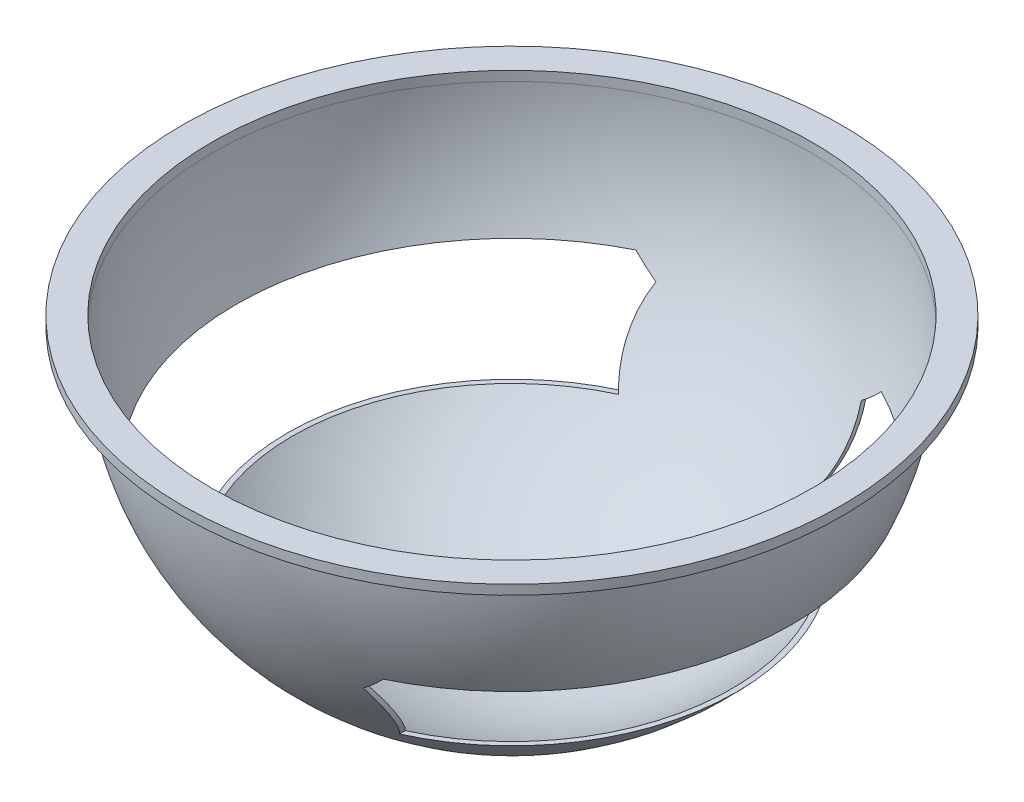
from build123d import *

# Parameters (mm, degrees)
CUT_EXTRUDE1_DEPTH  = 350.753019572
SKETCH3_R           = 219.075
SKETCH3_R_2         = 199.39
BOSS_EXTRUDE1_DEPTH = 6.35


with BuildPart() as part:
    # Sketch1 → Revolve1 (revolve)
    with BuildSketch(Plane.XY):
        with BuildLine():
            Line((-201.93, 0), (-199.39, 0))
            ThreePointArc((-199.39, 0), (-140.990021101, -140.990021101), (0, -199.39))
            Line((0, -199.39), (0, -201.93))
            ThreePointArc((0, -201.93), (-142.786072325, -142.786072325), (-201.93, 0))
        make_face()
    revolve(axis=Axis((0, 0, 0), (0, -1, 0)))

    # Sketch2 → Cut-Extrude1 (cut, symmetric)
    with BuildSketch(Plane.XY):
        with BuildLine():
            Line((183.067713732, -78.867), (81.541031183, -78.867))
            ThreePointArc((81.541031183, -78.867), (75.149641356, -84.979261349), (68.301537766, -90.575070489))
            add(Edge.make_bspline(
                [(68.301537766, -90.575070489), (68.996659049, -92.44085412), (70.164235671, -96.282804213), (71.152673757, -102.092341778), (71.396455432, -107.957170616), (70.888477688, -113.809427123), (69.632364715, -119.602149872), (67.634613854, -125.279529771), (65.359138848, -129.87111573), (63.187293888, -133.423807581), (61.977277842, -135.167325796), (61.351163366, -136.017)],
                knots=[2.598513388, 2.598513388, 2.598513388, 2.598513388, 2.703424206, 2.808335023, 2.91324584, 3.018156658, 3.123067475, 3.227978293, 3.33288911, 3.385344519, 3.437799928, 3.437799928, 3.437799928, 3.437799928], degree=3))
            Line((61.351163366, -136.017), (123.063, -136.017))
            Line((123.063, -136.017), (130.933617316, -136.017))
            Line((130.933617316, -136.017), (154.797267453, -136.017))
            Line((154.797267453, -136.017), (209.512820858, -136.017))
            Line((209.512820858, -136.017), (209.512820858, -78.867))
            Line((209.512820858, -78.867), (183.067713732, -78.867))
        make_face()
    cut_extrude1 = extrude(amount=CUT_EXTRUDE1_DEPTH, both=True, mode=Mode.SUBTRACT)

    # Mirror1: Cut-Extrude1 across plane
    add(cut_extrude1.mirror(Plane(origin=(0, 0, 0), x_dir=(0, 0, 1), z_dir=(1, 0, 0))), mode=Mode.SUBTRACT)

    # Sketch3 → Boss-Extrude1 (add)
    with BuildSketch(Plane(origin=(0, 0, 0), x_dir=(1, 0, 0), z_dir=(0, 1, 0))):
        with Locations(Location((0, 0, 0), (0, 0, 270))):
            Circle(SKETCH3_R)
        with Locations(Location((0, 0, 0), (0, 0, 270))):
            Circle(SKETCH3_R_2, mode=Mode.SUBTRACT)
    extrude(amount=BOSS_EXTRUDE1_DEPTH)


solid = part.part
